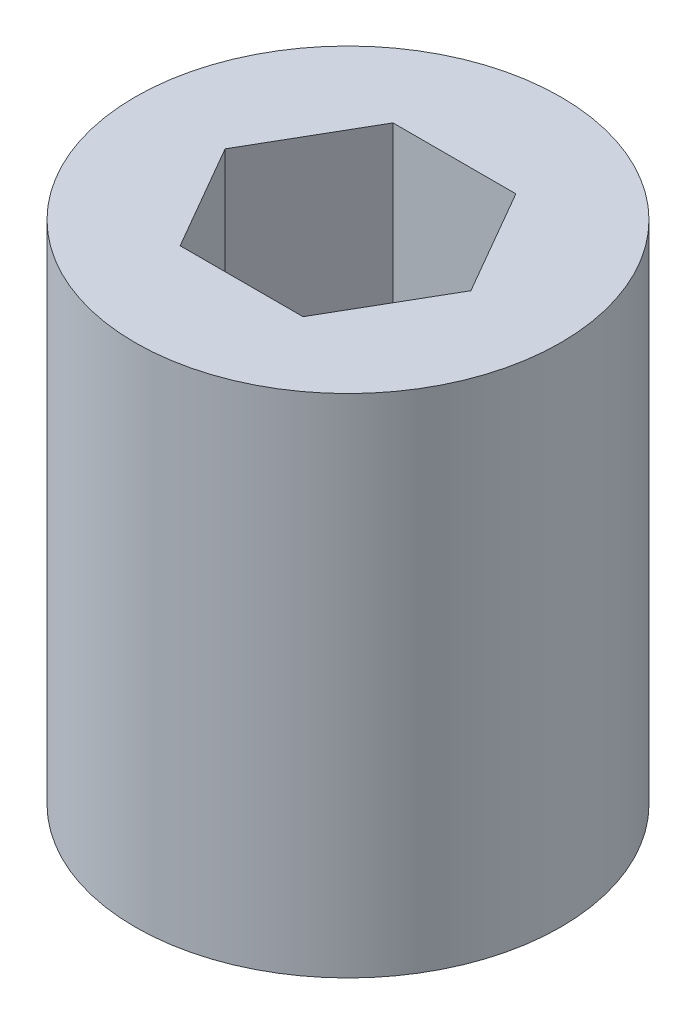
from build123d import *

# Parameters (mm, degrees)
DRIVE_SOCKET_DEPTH = 1.5


with BuildPart() as part:
    # profile → Base-Revolve (revolve)
    with BuildSketch(Plane.XY, mode=Mode.PRIVATE) as base_revolve_sk:
        Polygon((1.5, -3.566987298), (0.75, -4), (0, -3.566987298), (0, 0), (1.5, 0), align=None)
    revolve(base_revolve_sk.sketch.rotate(Axis((0, 9.907210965, 0), (0, -1, 0)), 90), axis=Axis((0, 9.907210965, 0), (0, -1, 0)))

    # socket → drive socket (cut)
    with BuildSketch(Plane(origin=(0, 0, 0), x_dir=(-1, 0, 0), z_dir=(0, 1, 0))):
        Polygon((0.866025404, 0), (0.433012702, 0.75), (-0.433012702, 0.75), (-0.866025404, 0), (-0.433012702, -0.75), (0.433012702, -0.75), align=None)
    extrude(amount=-DRIVE_SOCKET_DEPTH, mode=Mode.SUBTRACT)


solid = part.part
